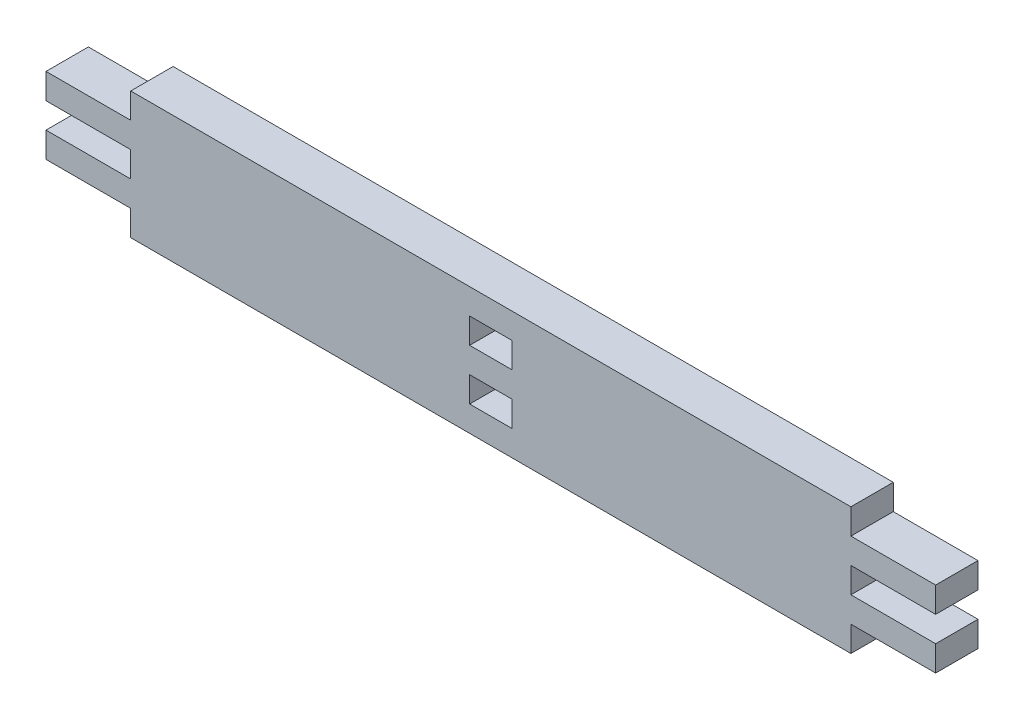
from build123d import *

# Parameters (mm, degrees)
SKETCH1_W           = 63
SKETCH1_H           = 9
BOSS_EXTRUDE1_DEPTH = 3
SKETCH2_W           = 6
SKETCH2_H           = 1.8
CUT_EXTRUDE1_DEPTH  = 10
SKETCH3_W           = 3
SKETCH3_H           = 1.8
CUT_EXTRUDE2_DEPTH  = 10


with BuildPart() as part:
    # Sketch1 → Boss-Extrude1 (new body)
    with BuildSketch(Plane.XY):
        Rectangle(SKETCH1_W, SKETCH1_H)
    extrude(amount=BOSS_EXTRUDE1_DEPTH)

    # Sketch2 → Cut-Extrude1 (cut)
    with BuildSketch(Plane.XY.offset(3)):
        with Locations((-28.5, 3.6)):
            Rectangle(SKETCH2_W, SKETCH2_H)
        with Locations((-28.5, 0)):
            Rectangle(SKETCH2_W, SKETCH2_H)
        with Locations((-28.5, -3.6)):
            Rectangle(SKETCH2_W, SKETCH2_H)
    cut_extrude1 = extrude(amount=-CUT_EXTRUDE1_DEPTH, mode=Mode.SUBTRACT)

    # Mirror1: Cut-Extrude1 across plane
    add(cut_extrude1.mirror(Plane(origin=(0, 0, 0), x_dir=(0, 0, 1), z_dir=(1, 0, 0))), mode=Mode.SUBTRACT)

    # Sketch3 → Cut-Extrude2 (cut)
    with BuildSketch(Plane.XY.offset(3)):
        with Locations((0, 1.8)):
            Rectangle(SKETCH3_W, SKETCH3_H)
        with Locations((0, -1.8)):
            Rectangle(SKETCH3_W, SKETCH3_H)
    extrude(amount=-CUT_EXTRUDE2_DEPTH, mode=Mode.SUBTRACT)


solid = part.part
